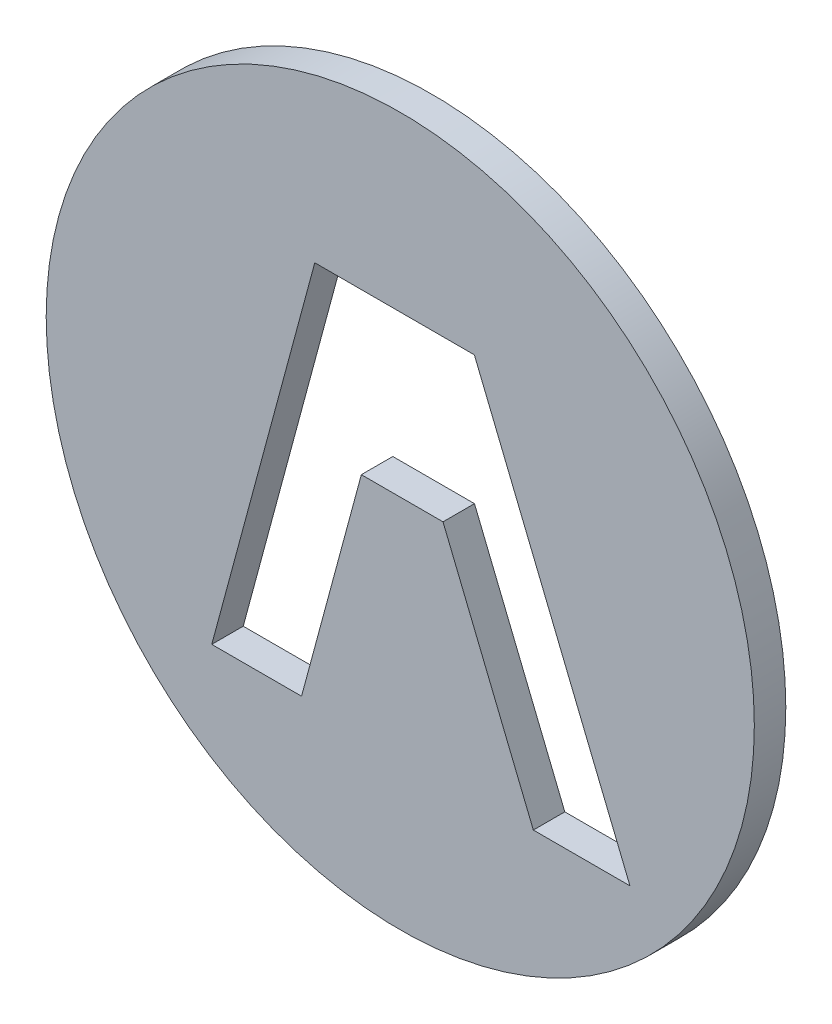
ISO-10303-21;
HEADER;
FILE_DESCRIPTION(('STEP AP214'),'2;1');
FILE_NAME('part.step','',(''),(''),'','','');
FILE_SCHEMA(('AUTOMOTIVE_DESIGN { 1 0 10303 214 1 1 1 1 }'));
ENDSEC;
DATA;
#1=APPLICATION_CONTEXT('core data for automotive mechanical design processes');
#2=APPLICATION_PROTOCOL_DEFINITION('international standard','automotive_design',2000,#1);
#3=PRODUCT_CONTEXT('',#1,'mechanical');
#4=PRODUCT('Part','Part','',(#3));
#5=PRODUCT_RELATED_PRODUCT_CATEGORY('part','',(#4));
#6=PRODUCT_DEFINITION_FORMATION('','',#4);
#7=PRODUCT_DEFINITION_CONTEXT('part definition',#1,'design');
#8=PRODUCT_DEFINITION('design','',#6,#7);
#9=PRODUCT_DEFINITION_SHAPE('','',#8);
#10=(LENGTH_UNIT() NAMED_UNIT(*) SI_UNIT(.MILLI.,.METRE.));
#11=(NAMED_UNIT(*) PLANE_ANGLE_UNIT() SI_UNIT($,.RADIAN.));
#12=(NAMED_UNIT(*) SI_UNIT($,.STERADIAN.) SOLID_ANGLE_UNIT());
#13=UNCERTAINTY_MEASURE_WITH_UNIT(LENGTH_MEASURE(1.E-05),#10,'distance_accuracy_value','');
#14=(GEOMETRIC_REPRESENTATION_CONTEXT(3) GLOBAL_UNCERTAINTY_ASSIGNED_CONTEXT((#13)) GLOBAL_UNIT_ASSIGNED_CONTEXT((#10,
#11,#12)) REPRESENTATION_CONTEXT('',''));
#15=CARTESIAN_POINT('',(0.,0.,0.));
#16=DIRECTION('',(0.,0.,1.));
#17=DIRECTION('',(1.,0.,0.));
#18=AXIS2_PLACEMENT_3D('',#15,#16,#17);
#19=CARTESIAN_POINT('',(0.,-3.47347540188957,4.));
#20=DIRECTION('',(0.,0.,-1.));
#21=DIRECTION('',(-1.,0.,0.));
#22=AXIS2_PLACEMENT_3D('',#19,#20,#21);
#23=CYLINDRICAL_SURFACE('',#22,45.);
#24=CARTESIAN_POINT('',(0.,-3.47347540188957,4.));
#25=DIRECTION('',(0.,0.,1.));
#26=DIRECTION('',(1.,0.,0.));
#27=AXIS2_PLACEMENT_3D('',#24,#25,#26);
#28=CIRCLE('',#27,45.);
#29=CARTESIAN_POINT('',(45.,-3.47347540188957,4.));
#30=VERTEX_POINT('',#29);
#31=EDGE_CURVE('E11',#30,#30,#28,.T.);
#32=ORIENTED_EDGE('',*,*,#31,.F.);
#33=EDGE_LOOP('',(#32));
#34=FACE_BOUND('',#33,.T.);
#35=CARTESIAN_POINT('',(0.,-3.47347540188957,0.));
#36=DIRECTION('',(0.,0.,1.));
#37=DIRECTION('',(1.,0.,0.));
#38=AXIS2_PLACEMENT_3D('',#35,#36,#37);
#39=CIRCLE('',#38,45.);
#40=CARTESIAN_POINT('',(45.,-3.47347540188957,0.));
#41=VERTEX_POINT('',#40);
#42=EDGE_CURVE('E36',#41,#41,#39,.T.);
#43=ORIENTED_EDGE('',*,*,#42,.T.);
#44=EDGE_LOOP('',(#43));
#45=FACE_BOUND('',#44,.T.);
#46=ADVANCED_FACE('F33',(#34,#45),#23,.T.);
#47=CARTESIAN_POINT('',(0.,-3.47347540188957,4.));
#48=DIRECTION('',(0.,0.,1.));
#49=DIRECTION('',(1.,0.,0.));
#50=AXIS2_PLACEMENT_3D('',#47,#48,#49);
#51=PLANE('',#50);
#52=DIRECTION('',(-1.,0.,0.));
#53=VECTOR('',#52,1.);
#54=CARTESIAN_POINT('',(9.41737268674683,19.5298067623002,4.));
#55=LINE('',#54,#53);
#56=CARTESIAN_POINT('',(9.41737268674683,19.5298067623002,4.));
#57=VERTEX_POINT('',#56);
#58=CARTESIAN_POINT('',(-10.8636542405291,19.5298067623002,4.));
#59=VERTEX_POINT('',#58);
#60=EDGE_CURVE('E47',#57,#59,#55,.T.);
#61=ORIENTED_EDGE('',*,*,#60,.F.);
#62=DIRECTION('',(-0.377193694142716,0.926134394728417,0.));
#63=VECTOR('',#62,1.);
#64=CARTESIAN_POINT('',(29.1916651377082,-29.0225753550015,4.));
#65=LINE('',#64,#63);
#66=CARTESIAN_POINT('',(29.1916651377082,-29.0225753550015,4.));
#67=VERTEX_POINT('',#66);
#68=EDGE_CURVE('E116',#67,#57,#65,.T.);
#69=ORIENTED_EDGE('',*,*,#68,.F.);
#70=DIRECTION('',(1.,0.,0.));
#71=VECTOR('',#70,1.);
#72=CARTESIAN_POINT('',(16.9115038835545,-29.0225753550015,4.));
#73=LINE('',#72,#71);
#74=CARTESIAN_POINT('',(16.9115038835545,-29.0225753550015,4.));
#75=VERTEX_POINT('',#74);
#76=EDGE_CURVE('E119',#75,#67,#73,.T.);
#77=ORIENTED_EDGE('',*,*,#76,.F.);
#78=DIRECTION('',(0.377193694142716,-0.926134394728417,0.));
#79=VECTOR('',#78,1.);
#80=CARTESIAN_POINT('',(5.43204571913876,-0.836735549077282,4.));
#81=LINE('',#80,#79);
#82=CARTESIAN_POINT('',(5.43204571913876,-0.836735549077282,4.));
#83=VERTEX_POINT('',#82);
#84=EDGE_CURVE('E147',#83,#75,#81,.T.);
#85=ORIENTED_EDGE('',*,*,#84,.F.);
#86=DIRECTION('',(1.,0.,0.));
#87=VECTOR('',#86,1.);
#88=CARTESIAN_POINT('',(-4.94656891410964,-0.836735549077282,4.));
#89=LINE('',#88,#87);
#90=CARTESIAN_POINT('',(-4.94656891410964,-0.836735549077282,4.));
#91=VERTEX_POINT('',#90);
#92=EDGE_CURVE('E144',#91,#83,#89,.T.);
#93=ORIENTED_EDGE('',*,*,#92,.F.);
#94=DIRECTION('',(0.260362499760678,0.965510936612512,0.));
#95=VECTOR('',#94,1.);
#96=CARTESIAN_POINT('',(-12.5472448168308,-29.0225753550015,4.));
#97=LINE('',#96,#95);
#98=CARTESIAN_POINT('',(-12.5472448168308,-29.0225753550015,4.));
#99=VERTEX_POINT('',#98);
#100=EDGE_CURVE('E141',#99,#91,#97,.T.);
#101=ORIENTED_EDGE('',*,*,#100,.F.);
#102=DIRECTION('',(1.,0.,0.));
#103=VECTOR('',#102,1.);
#104=CARTESIAN_POINT('',(-23.9564314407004,-29.0225753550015,4.));
#105=LINE('',#104,#103);
#106=CARTESIAN_POINT('',(-23.9564314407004,-29.0225753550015,4.));
#107=VERTEX_POINT('',#106);
#108=EDGE_CURVE('E138',#107,#99,#105,.T.);
#109=ORIENTED_EDGE('',*,*,#108,.F.);
#110=DIRECTION('',(-0.260362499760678,-0.965510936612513,0.));
#111=VECTOR('',#110,1.);
#112=CARTESIAN_POINT('',(-10.8636542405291,19.5298067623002,4.));
#113=LINE('',#112,#111);
#114=EDGE_CURVE('E136',#59,#107,#113,.T.);
#115=ORIENTED_EDGE('',*,*,#114,.F.);
#116=EDGE_LOOP('',(#61,#69,#77,#85,#93,#101,#109,#115));
#117=FACE_BOUND('',#116,.T.);
#118=ORIENTED_EDGE('',*,*,#31,.T.);
#119=EDGE_LOOP('',(#118));
#120=FACE_BOUND('',#119,.T.);
#121=ADVANCED_FACE('F168',(#117,#120),#51,.T.);
#122=CARTESIAN_POINT('',(0.,-3.47347540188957,0.));
#123=DIRECTION('',(0.,0.,1.));
#124=DIRECTION('',(1.,0.,0.));
#125=AXIS2_PLACEMENT_3D('',#122,#123,#124);
#126=PLANE('',#125);
#127=DIRECTION('',(-0.377193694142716,0.926134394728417,0.));
#128=VECTOR('',#127,1.);
#129=CARTESIAN_POINT('',(29.1916651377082,-29.0225753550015,0.));
#130=LINE('',#129,#128);
#131=CARTESIAN_POINT('',(29.1916651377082,-29.0225753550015,0.));
#132=VERTEX_POINT('',#131);
#133=CARTESIAN_POINT('',(9.41737268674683,19.5298067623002,0.));
#134=VERTEX_POINT('',#133);
#135=EDGE_CURVE('E105',#132,#134,#130,.T.);
#136=ORIENTED_EDGE('',*,*,#135,.T.);
#137=DIRECTION('',(-1.,0.,0.));
#138=VECTOR('',#137,1.);
#139=CARTESIAN_POINT('',(9.41737268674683,19.5298067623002,0.));
#140=LINE('',#139,#138);
#141=CARTESIAN_POINT('',(-10.8636542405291,19.5298067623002,0.));
#142=VERTEX_POINT('',#141);
#143=EDGE_CURVE('E99',#134,#142,#140,.T.);
#144=ORIENTED_EDGE('',*,*,#143,.T.);
#145=DIRECTION('',(-0.260362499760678,-0.965510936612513,0.));
#146=VECTOR('',#145,1.);
#147=CARTESIAN_POINT('',(-10.8636542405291,19.5298067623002,0.));
#148=LINE('',#147,#146);
#149=CARTESIAN_POINT('',(-23.9564314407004,-29.0225753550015,0.));
#150=VERTEX_POINT('',#149);
#151=EDGE_CURVE('E108',#142,#150,#148,.T.);
#152=ORIENTED_EDGE('',*,*,#151,.T.);
#153=DIRECTION('',(1.,0.,0.));
#154=VECTOR('',#153,1.);
#155=CARTESIAN_POINT('',(-23.9564314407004,-29.0225753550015,0.));
#156=LINE('',#155,#154);
#157=CARTESIAN_POINT('',(-12.5472448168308,-29.0225753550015,0.));
#158=VERTEX_POINT('',#157);
#159=EDGE_CURVE('E55',#150,#158,#156,.T.);
#160=ORIENTED_EDGE('',*,*,#159,.T.);
#161=DIRECTION('',(0.260362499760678,0.965510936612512,0.));
#162=VECTOR('',#161,1.);
#163=CARTESIAN_POINT('',(-12.5472448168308,-29.0225753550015,0.));
#164=LINE('',#163,#162);
#165=CARTESIAN_POINT('',(-4.94656891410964,-0.836735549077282,0.));
#166=VERTEX_POINT('',#165);
#167=EDGE_CURVE('E123',#158,#166,#164,.T.);
#168=ORIENTED_EDGE('',*,*,#167,.T.);
#169=DIRECTION('',(1.,0.,0.));
#170=VECTOR('',#169,1.);
#171=CARTESIAN_POINT('',(-4.94656891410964,-0.836735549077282,0.));
#172=LINE('',#171,#170);
#173=CARTESIAN_POINT('',(5.43204571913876,-0.836735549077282,0.));
#174=VERTEX_POINT('',#173);
#175=EDGE_CURVE('E126',#166,#174,#172,.T.);
#176=ORIENTED_EDGE('',*,*,#175,.T.);
#177=DIRECTION('',(0.377193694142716,-0.926134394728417,0.));
#178=VECTOR('',#177,1.);
#179=CARTESIAN_POINT('',(5.43204571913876,-0.836735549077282,0.));
#180=LINE('',#179,#178);
#181=CARTESIAN_POINT('',(16.9115038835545,-29.0225753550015,0.));
#182=VERTEX_POINT('',#181);
#183=EDGE_CURVE('E129',#174,#182,#180,.T.);
#184=ORIENTED_EDGE('',*,*,#183,.T.);
#185=DIRECTION('',(1.,0.,0.));
#186=VECTOR('',#185,1.);
#187=CARTESIAN_POINT('',(16.9115038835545,-29.0225753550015,0.));
#188=LINE('',#187,#186);
#189=EDGE_CURVE('E132',#182,#132,#188,.T.);
#190=ORIENTED_EDGE('',*,*,#189,.T.);
#191=EDGE_LOOP('',(#136,#144,#152,#160,#168,#176,#184,#190));
#192=FACE_BOUND('',#191,.T.);
#193=ORIENTED_EDGE('',*,*,#42,.F.);
#194=EDGE_LOOP('',(#193));
#195=FACE_BOUND('',#194,.T.);
#196=ADVANCED_FACE('F112',(#192,#195),#126,.F.);
#197=CARTESIAN_POINT('',(9.41737268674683,19.5298067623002,0.));
#198=DIRECTION('',(0.,1.,0.));
#199=DIRECTION('',(0.,0.,1.));
#200=AXIS2_PLACEMENT_3D('',#197,#198,#199);
#201=PLANE('',#200);
#202=ORIENTED_EDGE('',*,*,#60,.T.);
#203=DIRECTION('',(0.,0.,1.));
#204=VECTOR('',#203,1.);
#205=CARTESIAN_POINT('',(-10.8636542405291,19.5298067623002,0.));
#206=LINE('',#205,#204);
#207=EDGE_CURVE('E95',#142,#59,#206,.T.);
#208=ORIENTED_EDGE('',*,*,#207,.F.);
#209=ORIENTED_EDGE('',*,*,#143,.F.);
#210=DIRECTION('',(0.,0.,1.));
#211=VECTOR('',#210,1.);
#212=CARTESIAN_POINT('',(9.41737268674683,19.5298067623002,0.));
#213=LINE('',#212,#211);
#214=EDGE_CURVE('E152',#134,#57,#213,.T.);
#215=ORIENTED_EDGE('',*,*,#214,.T.);
#216=EDGE_LOOP('',(#202,#208,#209,#215));
#217=FACE_BOUND('',#216,.T.);
#218=ADVANCED_FACE('F97',(#217),#201,.F.);
#219=CARTESIAN_POINT('',(29.1916651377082,-29.0225753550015,0.));
#220=DIRECTION('',(0.926134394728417,0.377193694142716,0.));
#221=DIRECTION('',(-0.377193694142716,0.926134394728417,0.));
#222=AXIS2_PLACEMENT_3D('',#219,#220,#221);
#223=PLANE('',#222);
#224=ORIENTED_EDGE('',*,*,#68,.T.);
#225=ORIENTED_EDGE('',*,*,#214,.F.);
#226=ORIENTED_EDGE('',*,*,#135,.F.);
#227=DIRECTION('',(0.,0.,1.));
#228=VECTOR('',#227,1.);
#229=CARTESIAN_POINT('',(29.1916651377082,-29.0225753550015,0.));
#230=LINE('',#229,#228);
#231=EDGE_CURVE('E154',#132,#67,#230,.T.);
#232=ORIENTED_EDGE('',*,*,#231,.T.);
#233=EDGE_LOOP('',(#224,#225,#226,#232));
#234=FACE_BOUND('',#233,.T.);
#235=ADVANCED_FACE('F187',(#234),#223,.F.);
#236=CARTESIAN_POINT('',(16.9115038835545,-29.0225753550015,0.));
#237=DIRECTION('',(0.,-1.,0.));
#238=DIRECTION('',(0.,0.,-1.));
#239=AXIS2_PLACEMENT_3D('',#236,#237,#238);
#240=PLANE('',#239);
#241=ORIENTED_EDGE('',*,*,#76,.T.);
#242=ORIENTED_EDGE('',*,*,#231,.F.);
#243=ORIENTED_EDGE('',*,*,#189,.F.);
#244=DIRECTION('',(0.,0.,1.));
#245=VECTOR('',#244,1.);
#246=CARTESIAN_POINT('',(16.9115038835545,-29.0225753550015,0.));
#247=LINE('',#246,#245);
#248=EDGE_CURVE('E156',#182,#75,#247,.T.);
#249=ORIENTED_EDGE('',*,*,#248,.T.);
#250=EDGE_LOOP('',(#241,#242,#243,#249));
#251=FACE_BOUND('',#250,.T.);
#252=ADVANCED_FACE('F184',(#251),#240,.F.);
#253=CARTESIAN_POINT('',(5.43204571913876,-0.836735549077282,0.));
#254=DIRECTION('',(-0.926134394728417,-0.377193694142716,0.));
#255=DIRECTION('',(0.377193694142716,-0.926134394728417,0.));
#256=AXIS2_PLACEMENT_3D('',#253,#254,#255);
#257=PLANE('',#256);
#258=ORIENTED_EDGE('',*,*,#84,.T.);
#259=ORIENTED_EDGE('',*,*,#248,.F.);
#260=ORIENTED_EDGE('',*,*,#183,.F.);
#261=DIRECTION('',(0.,0.,1.));
#262=VECTOR('',#261,1.);
#263=CARTESIAN_POINT('',(5.43204571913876,-0.836735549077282,0.));
#264=LINE('',#263,#262);
#265=EDGE_CURVE('E158',#174,#83,#264,.T.);
#266=ORIENTED_EDGE('',*,*,#265,.T.);
#267=EDGE_LOOP('',(#258,#259,#260,#266));
#268=FACE_BOUND('',#267,.T.);
#269=ADVANCED_FACE('F180',(#268),#257,.F.);
#270=CARTESIAN_POINT('',(-4.94656891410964,-0.836735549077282,0.));
#271=DIRECTION('',(0.,-1.,0.));
#272=DIRECTION('',(0.,0.,-1.));
#273=AXIS2_PLACEMENT_3D('',#270,#271,#272);
#274=PLANE('',#273);
#275=ORIENTED_EDGE('',*,*,#92,.T.);
#276=ORIENTED_EDGE('',*,*,#265,.F.);
#277=ORIENTED_EDGE('',*,*,#175,.F.);
#278=DIRECTION('',(0.,0.,1.));
#279=VECTOR('',#278,1.);
#280=CARTESIAN_POINT('',(-4.94656891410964,-0.836735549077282,0.));
#281=LINE('',#280,#279);
#282=EDGE_CURVE('E160',#166,#91,#281,.T.);
#283=ORIENTED_EDGE('',*,*,#282,.T.);
#284=EDGE_LOOP('',(#275,#276,#277,#283));
#285=FACE_BOUND('',#284,.T.);
#286=ADVANCED_FACE('F178',(#285),#274,.F.);
#287=CARTESIAN_POINT('',(-12.5472448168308,-29.0225753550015,0.));
#288=DIRECTION('',(0.965510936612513,-0.260362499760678,0.));
#289=DIRECTION('',(0.260362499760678,0.965510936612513,0.));
#290=AXIS2_PLACEMENT_3D('',#287,#288,#289);
#291=PLANE('',#290);
#292=ORIENTED_EDGE('',*,*,#100,.T.);
#293=ORIENTED_EDGE('',*,*,#282,.F.);
#294=ORIENTED_EDGE('',*,*,#167,.F.);
#295=DIRECTION('',(0.,0.,1.));
#296=VECTOR('',#295,1.);
#297=CARTESIAN_POINT('',(-12.5472448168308,-29.0225753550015,0.));
#298=LINE('',#297,#296);
#299=EDGE_CURVE('E162',#158,#99,#298,.T.);
#300=ORIENTED_EDGE('',*,*,#299,.T.);
#301=EDGE_LOOP('',(#292,#293,#294,#300));
#302=FACE_BOUND('',#301,.T.);
#303=ADVANCED_FACE('F173',(#302),#291,.F.);
#304=CARTESIAN_POINT('',(-23.9564314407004,-29.0225753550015,0.));
#305=DIRECTION('',(0.,-1.,0.));
#306=DIRECTION('',(0.,0.,-1.));
#307=AXIS2_PLACEMENT_3D('',#304,#305,#306);
#308=PLANE('',#307);
#309=ORIENTED_EDGE('',*,*,#108,.T.);
#310=ORIENTED_EDGE('',*,*,#299,.F.);
#311=ORIENTED_EDGE('',*,*,#159,.F.);
#312=DIRECTION('',(0.,0.,1.));
#313=VECTOR('',#312,1.);
#314=CARTESIAN_POINT('',(-23.9564314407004,-29.0225753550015,0.));
#315=LINE('',#314,#313);
#316=EDGE_CURVE('E104',#150,#107,#315,.T.);
#317=ORIENTED_EDGE('',*,*,#316,.T.);
#318=EDGE_LOOP('',(#309,#310,#311,#317));
#319=FACE_BOUND('',#318,.T.);
#320=ADVANCED_FACE('F164',(#319),#308,.F.);
#321=CARTESIAN_POINT('',(-10.8636542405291,19.5298067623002,0.));
#322=DIRECTION('',(-0.965510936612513,0.260362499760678,0.));
#323=DIRECTION('',(-0.260362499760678,-0.965510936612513,0.));
#324=AXIS2_PLACEMENT_3D('',#321,#322,#323);
#325=PLANE('',#324);
#326=ORIENTED_EDGE('',*,*,#114,.T.);
#327=ORIENTED_EDGE('',*,*,#316,.F.);
#328=ORIENTED_EDGE('',*,*,#151,.F.);
#329=ORIENTED_EDGE('',*,*,#207,.T.);
#330=EDGE_LOOP('',(#326,#327,#328,#329));
#331=FACE_BOUND('',#330,.T.);
#332=ADVANCED_FACE('F109',(#331),#325,.F.);
#333=CLOSED_SHELL('',(#46,#121,#196,#218,#235,#252,#269,#286,#303,#320,#332));
#334=MANIFOLD_SOLID_BREP('B2',#333);
#335=ADVANCED_BREP_SHAPE_REPRESENTATION('',(#18,#334),#14);
#336=SHAPE_DEFINITION_REPRESENTATION(#9,#335);
ENDSEC;
END-ISO-10303-21;
